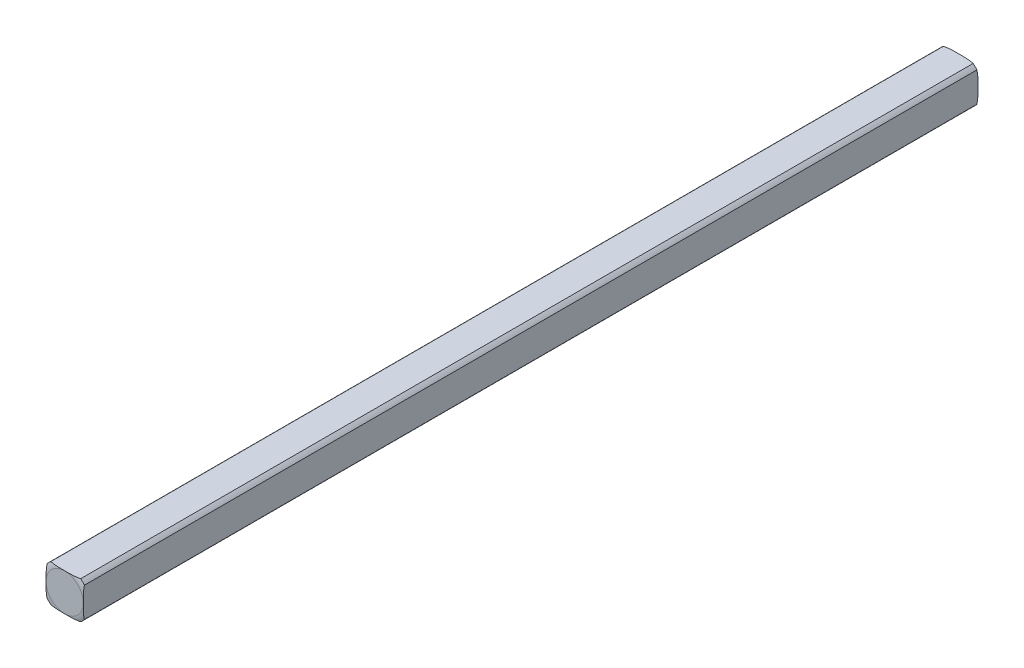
from build123d import *

# Parameters (mm, degrees)
BOSS_EXTRUDE1_DEPTH = 38.1


with BuildPart() as part:
    # Sketch1 → Boss-Extrude1 (new, symmetric)
    with BuildSketch(Plane.XY):
        with BuildLine():
            Line((-1.268411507, -1.5875), (1.268411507, -1.5875))
            ThreePointArc((1.268411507, -1.5875), (1.436840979, -1.436840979), (1.5875, -1.268411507))
            Line((1.5875, -1.268411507), (1.5875, 1.268411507))
            ThreePointArc((1.5875, 1.268411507), (1.436840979, 1.436840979), (1.268411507, 1.5875))
            Line((1.268411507, 1.5875), (-1.268411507, 1.5875))
            ThreePointArc((-1.268411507, 1.5875), (-1.436840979, 1.436840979), (-1.5875, 1.268411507))
            Line((-1.5875, 1.268411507), (-1.5875, -1.268411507))
            ThreePointArc((-1.5875, -1.268411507), (-1.436840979, -1.436840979), (-1.268411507, -1.5875))
        make_face()
    extrude(amount=BOSS_EXTRUDE1_DEPTH, both=True)

    # Cut-Sweep1: sweep along a path in Sketch2
    with BuildLine(Plane.XY.offset(38.1)) as cut_sweep1_path:
        CenterArc((0, 0), 1.5, 0, 360)
    # Sketch4 → Cut-Sweep1 (sweep, cut)
    with BuildSketch(Plane(origin=(0, 0, 0), x_dir=(0, 0, -1), z_dir=(1, 0, 0))):
        with BuildLine():
            Line((-37.846, 3.159800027), (-37.042316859, 3.159800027))
            Line((-37.042316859, 3.159800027), (-37.593953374, 2.592215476))
            ThreePointArc((-37.593953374, 2.592215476), (-37.976201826, 2.106370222), (-38.1, 1.500702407))
            Line((-38.1, 1.500702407), (-39.075223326, 1.500702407))
            Line((-39.075223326, 1.500702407), (-39.075223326, 3.159800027))
            Line((-39.075223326, 3.159800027), (-37.846, 3.159800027))
        make_face()
    cut_sweep1 = sweep(path=cut_sweep1_path.line, mode=Mode.SUBTRACT)

    # Mirror1: Cut-Sweep1 across plane
    add(cut_sweep1.mirror(Plane.XY), mode=Mode.SUBTRACT)


solid = part.part
